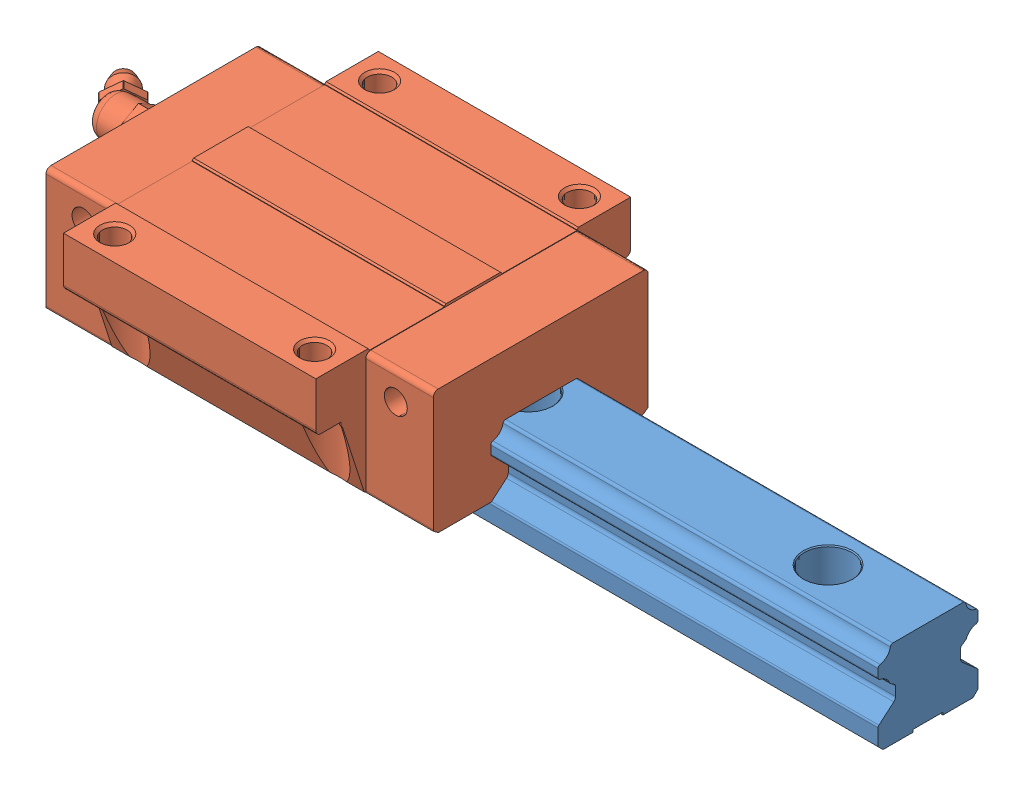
SolidWorks assembly HLW20CC.stp.sldasm, configuration 默认 (file format 13000). Lengths in mm.
Overall size (169.43 30 63).
2 component instances, 2 part files, 0 mates.
Components (placement in the parent):
- HLR20R160 E=20-1: HLR20R160 E=20.SLDPRT [默认] at origin size (160 17.5 20)
- HLW20CC-1: HLW20CC.SLDPRT [默认] at (5 4.6 0) size (91.93 25.4 63)
